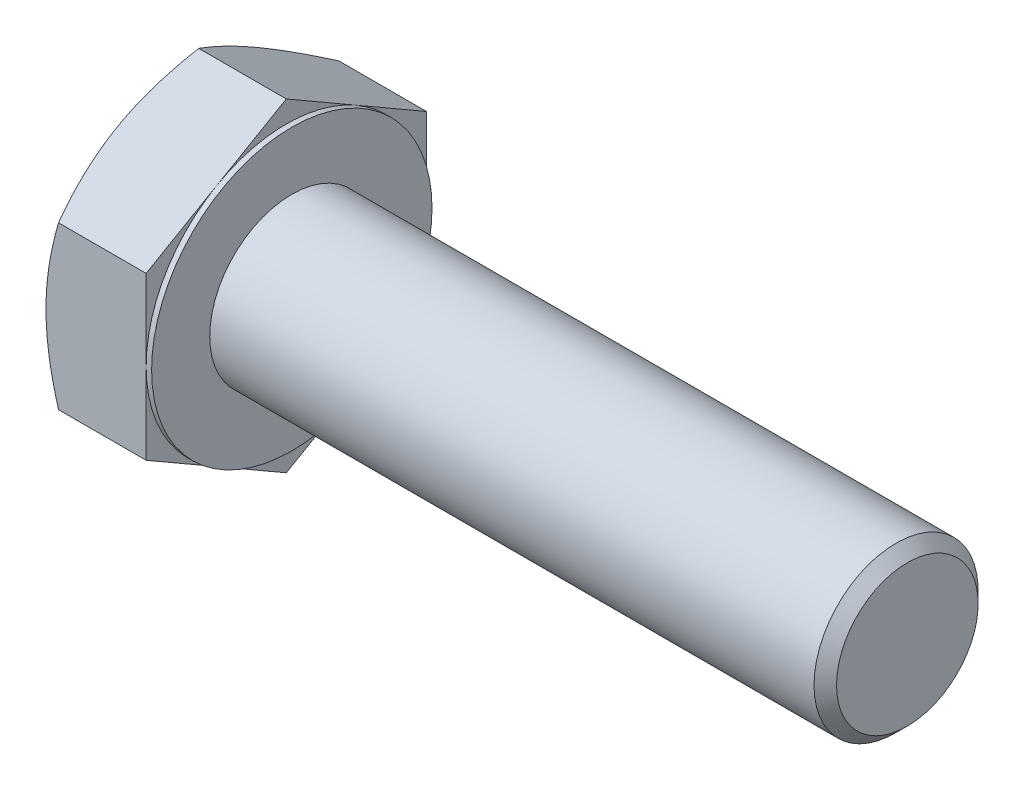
from build123d import *

# Parameters (mm, degrees)
BASEHEAD_DEPTH = 15.44
SKETCH4_W      = 0.8
SKETCH4_H      = 13.171361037


with BuildPart() as part:
    # Sketch1 → BaseHead (new body)
    with BuildSketch(Plane(origin=(0, 0, 0), x_dir=(0, 0, -1), z_dir=(1, 0, 0))):
        Polygon((20.5, 11.835680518), (20.5, -11.835680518), (0, -23.671361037), (-20.5, -11.835680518), (-20.5, 11.835680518), (0, 23.671361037), align=None)
    extrude(amount=BASEHEAD_DEPTH)

    # BodySke → BaseBody (revolve)
    with BuildSketch(Plane.XY, mode=Mode.PRIVATE) as basebody_sk:
        Polygon((0, 0), (105.44, 0), (105.44, 10.352), (103.792, 12), (0, 12), align=None)
    revolve(basebody_sk.sketch.rotate(Axis((0, 0, 0), (1, 0, 0)), 90), axis=Axis((0, 0, 0), (1, 0, 0)))

    # Sketch3 → HeadChamfer (revolve, cut)
    with BuildSketch(Plane.XY):
        Polygon((0, 20.5), (4.717737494, 28.671361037), (4.717737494, 33.671361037), (-10, 33.671361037), (-10, 20.5), align=None)
    revolve(axis=Axis((0, 0, 0), (1, 0, 0)), mode=Mode.SUBTRACT)

    # Sketch4 → BearingFace (revolve, cut)
    with BuildSketch(Plane.XY, mode=Mode.PRIVATE) as bearingface_sk:
        with Locations((15.04, 27.085680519)):
            Rectangle(SKETCH4_W, SKETCH4_H)
    revolve(bearingface_sk.sketch.rotate(Axis((0, 0, 0), (1, 0, 0)), 270), axis=Axis((0, 0, 0), (1, 0, 0)), mode=Mode.SUBTRACT)


solid = part.part
